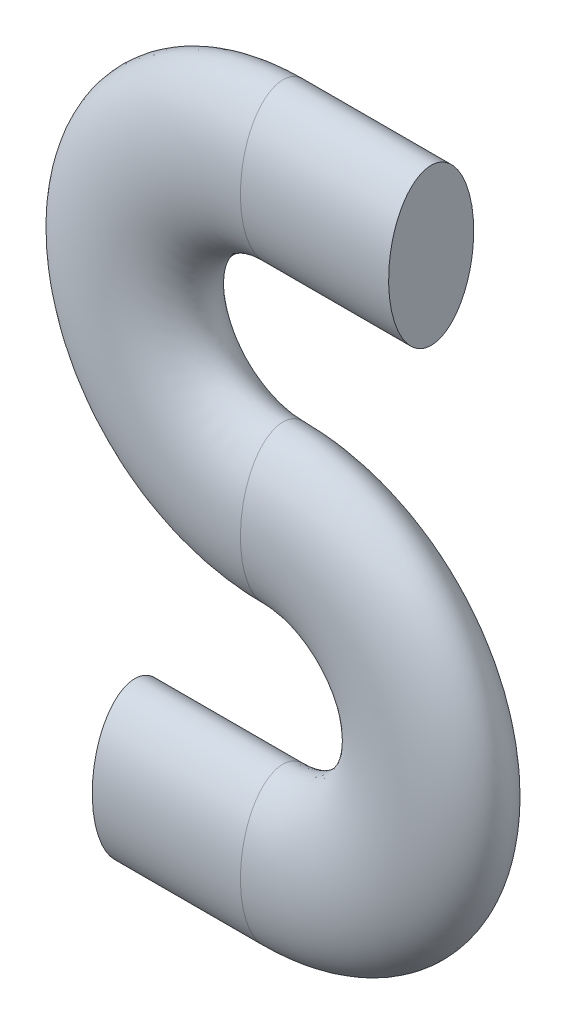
ISO-10303-21;
HEADER;
FILE_DESCRIPTION(('STEP AP214'),'2;1');
FILE_NAME('part.step','',(''),(''),'','','');
FILE_SCHEMA(('AUTOMOTIVE_DESIGN { 1 0 10303 214 1 1 1 1 }'));
ENDSEC;
DATA;
#1=APPLICATION_CONTEXT('core data for automotive mechanical design processes');
#2=APPLICATION_PROTOCOL_DEFINITION('international standard','automotive_design',2000,#1);
#3=PRODUCT_CONTEXT('',#1,'mechanical');
#4=PRODUCT('Part','Part','',(#3));
#5=PRODUCT_RELATED_PRODUCT_CATEGORY('part','',(#4));
#6=PRODUCT_DEFINITION_FORMATION('','',#4);
#7=PRODUCT_DEFINITION_CONTEXT('part definition',#1,'design');
#8=PRODUCT_DEFINITION('design','',#6,#7);
#9=PRODUCT_DEFINITION_SHAPE('','',#8);
#10=(LENGTH_UNIT() NAMED_UNIT(*) SI_UNIT(.MILLI.,.METRE.));
#11=(NAMED_UNIT(*) PLANE_ANGLE_UNIT() SI_UNIT($,.RADIAN.));
#12=(NAMED_UNIT(*) SI_UNIT($,.STERADIAN.) SOLID_ANGLE_UNIT());
#13=UNCERTAINTY_MEASURE_WITH_UNIT(LENGTH_MEASURE(1.E-05),#10,'distance_accuracy_value','');
#14=(GEOMETRIC_REPRESENTATION_CONTEXT(3) GLOBAL_UNCERTAINTY_ASSIGNED_CONTEXT((#13)) GLOBAL_UNIT_ASSIGNED_CONTEXT((#10,
#11,#12)) REPRESENTATION_CONTEXT('',''));
#15=CARTESIAN_POINT('',(0.,0.,0.));
#16=DIRECTION('',(0.,0.,1.));
#17=DIRECTION('',(1.,0.,0.));
#18=AXIS2_PLACEMENT_3D('',#15,#16,#17);
#19=CARTESIAN_POINT('',(13.9288805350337,55.7155221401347,0.));
#20=DIRECTION('',(1.,0.,0.));
#21=DIRECTION('',(0.,1.,0.));
#22=AXIS2_PLACEMENT_3D('',#19,#20,#21);
#23=ELLIPSE('',#22,7.33056886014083,4.);
#24=DIRECTION('',(1.,0.,0.));
#25=VECTOR('',#24,1.);
#26=SURFACE_OF_LINEAR_EXTRUSION('',#23,#25);
#27=CARTESIAN_POINT('',(13.9288805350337,63.0460910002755,0.));
#28=VERTEX_POINT('',#27);
#29=EDGE_CURVE('E36',#28,#28,#23,.T.);
#30=ORIENTED_EDGE('',*,*,#29,.T.);
#31=EDGE_LOOP('',(#30));
#32=FACE_BOUND('',#31,.T.);
#33=CARTESIAN_POINT('',(27.8577610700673,55.7155221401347,0.));
#34=DIRECTION('',(1.,0.,0.));
#35=DIRECTION('',(0.,1.,0.));
#36=AXIS2_PLACEMENT_3D('',#33,#34,#35);
#37=ELLIPSE('',#36,7.33056886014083,4.);
#38=CARTESIAN_POINT('',(27.8577610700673,63.0460910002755,0.));
#39=VERTEX_POINT('',#38);
#40=EDGE_CURVE('E10',#39,#39,#37,.T.);
#41=ORIENTED_EDGE('',*,*,#40,.F.);
#42=EDGE_LOOP('',(#41));
#43=FACE_BOUND('',#42,.T.);
#44=ADVANCED_FACE('F30',(#32,#43),#26,.T.);
#45=CARTESIAN_POINT('',(13.9288805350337,27.8577610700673,0.));
#46=DIRECTION('',(-1.,0.,0.));
#47=DIRECTION('',(0.,-1.,0.));
#48=AXIS2_PLACEMENT_3D('',#45,#46,#47);
#49=ELLIPSE('',#48,7.33056886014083,4.);
#50=CARTESIAN_POINT('',(13.9288805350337,41.786641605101,0.));
#51=DIRECTION('',(0.,0.,-1.));
#52=AXIS1_PLACEMENT('',#50,#51);
#53=SURFACE_OF_REVOLUTION('',#49,#52);
#54=CARTESIAN_POINT('',(13.9288805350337,20.5271922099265,0.));
#55=VERTEX_POINT('',#54);
#56=EDGE_CURVE('E40',#55,#55,#49,.T.);
#57=ORIENTED_EDGE('',*,*,#56,.T.);
#58=EDGE_LOOP('',(#57));
#59=FACE_BOUND('',#58,.T.);
#60=ORIENTED_EDGE('',*,*,#29,.F.);
#61=EDGE_LOOP('',(#60));
#62=FACE_BOUND('',#61,.T.);
#63=ADVANCED_FACE('F51',(#59,#62),#53,.F.);
#64=CARTESIAN_POINT('',(13.9288805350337,0.,0.));
#65=DIRECTION('',(1.,0.,0.));
#66=DIRECTION('',(0.,1.,0.));
#67=AXIS2_PLACEMENT_3D('',#64,#65,#66);
#68=ELLIPSE('',#67,7.33056886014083,4.);
#69=CARTESIAN_POINT('',(13.9288805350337,13.9288805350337,0.));
#70=DIRECTION('',(0.,0.,1.));
#71=AXIS1_PLACEMENT('',#69,#70);
#72=SURFACE_OF_REVOLUTION('',#68,#71);
#73=CARTESIAN_POINT('',(13.9288805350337,7.33056886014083,0.));
#74=VERTEX_POINT('',#73);
#75=EDGE_CURVE('E44',#74,#74,#68,.T.);
#76=ORIENTED_EDGE('',*,*,#75,.T.);
#77=EDGE_LOOP('',(#76));
#78=FACE_BOUND('',#77,.T.);
#79=ORIENTED_EDGE('',*,*,#56,.F.);
#80=EDGE_LOOP('',(#79));
#81=FACE_BOUND('',#80,.T.);
#82=ADVANCED_FACE('F54',(#78,#81),#72,.F.);
#83=DIRECTION('',(-1.,0.,0.));
#84=VECTOR('',#83,1.);
#85=SURFACE_OF_LINEAR_EXTRUSION('',#68,#84);
#86=ORIENTED_EDGE('',*,*,#75,.F.);
#87=EDGE_LOOP('',(#86));
#88=FACE_BOUND('',#87,.T.);
#89=CARTESIAN_POINT('',(0.,0.,0.));
#90=DIRECTION('',(1.,0.,0.));
#91=DIRECTION('',(0.,1.,0.));
#92=AXIS2_PLACEMENT_3D('',#89,#90,#91);
#93=ELLIPSE('',#92,7.33056886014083,4.);
#94=CARTESIAN_POINT('',(0.,7.33056886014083,0.));
#95=VERTEX_POINT('',#94);
#96=EDGE_CURVE('E49',#95,#95,#93,.T.);
#97=ORIENTED_EDGE('',*,*,#96,.T.);
#98=EDGE_LOOP('',(#97));
#99=FACE_BOUND('',#98,.T.);
#100=ADVANCED_FACE('F58',(#88,#99),#85,.F.);
#101=CARTESIAN_POINT('',(27.8577610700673,55.7155221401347,0.));
#102=DIRECTION('',(1.,0.,0.));
#103=DIRECTION('',(0.,0.,-1.));
#104=AXIS2_PLACEMENT_3D('',#101,#102,#103);
#105=PLANE('',#104);
#106=ORIENTED_EDGE('',*,*,#40,.T.);
#107=EDGE_LOOP('',(#106));
#108=FACE_BOUND('',#107,.T.);
#109=ADVANCED_FACE('F71',(#108),#105,.T.);
#110=CARTESIAN_POINT('',(0.,0.,0.));
#111=DIRECTION('',(1.,0.,0.));
#112=DIRECTION('',(0.,0.,-1.));
#113=AXIS2_PLACEMENT_3D('',#110,#111,#112);
#114=PLANE('',#113);
#115=ORIENTED_EDGE('',*,*,#96,.F.);
#116=EDGE_LOOP('',(#115));
#117=FACE_BOUND('',#116,.T.);
#118=ADVANCED_FACE('F69',(#117),#114,.F.);
#119=CLOSED_SHELL('',(#44,#63,#82,#100,#109,#118));
#120=MANIFOLD_SOLID_BREP('B2',#119);
#121=ADVANCED_BREP_SHAPE_REPRESENTATION('',(#18,#120),#14);
#122=SHAPE_DEFINITION_REPRESENTATION(#9,#121);
ENDSEC;
END-ISO-10303-21;
